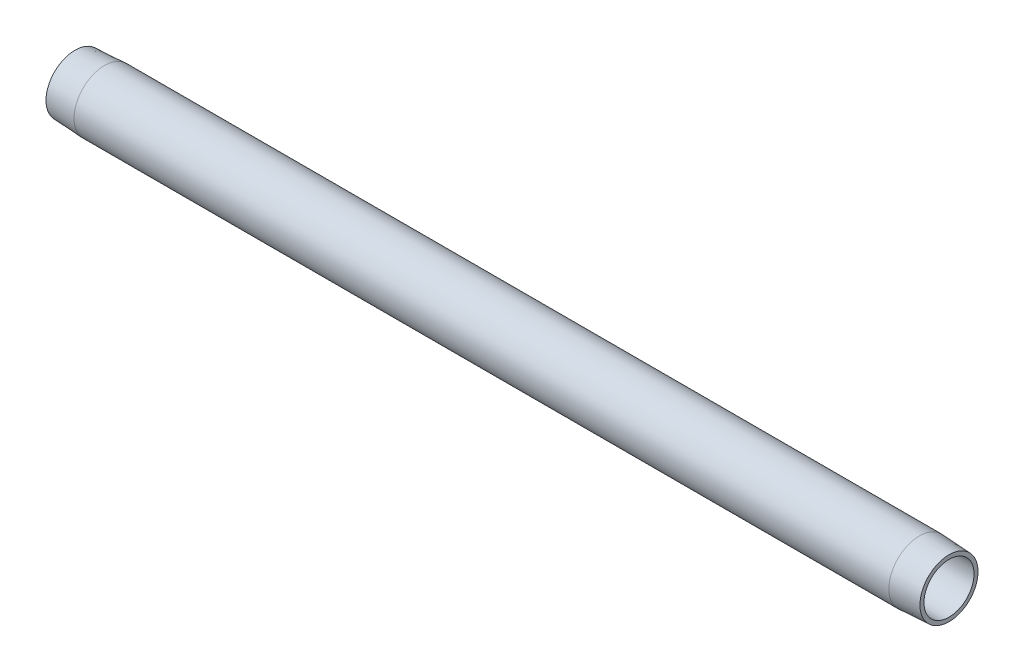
ISO-10303-21;
HEADER;
FILE_DESCRIPTION(('STEP AP214'),'2;1');
FILE_NAME('part.step','',(''),(''),'','','');
FILE_SCHEMA(('AUTOMOTIVE_DESIGN { 1 0 10303 214 1 1 1 1 }'));
ENDSEC;
DATA;
#1=APPLICATION_CONTEXT('core data for automotive mechanical design processes');
#2=APPLICATION_PROTOCOL_DEFINITION('international standard','automotive_design',2000,#1);
#3=PRODUCT_CONTEXT('',#1,'mechanical');
#4=PRODUCT('Part','Part','',(#3));
#5=PRODUCT_RELATED_PRODUCT_CATEGORY('part','',(#4));
#6=PRODUCT_DEFINITION_FORMATION('','',#4);
#7=PRODUCT_DEFINITION_CONTEXT('part definition',#1,'design');
#8=PRODUCT_DEFINITION('design','',#6,#7);
#9=PRODUCT_DEFINITION_SHAPE('','',#8);
#10=(LENGTH_UNIT() NAMED_UNIT(*) SI_UNIT(.MILLI.,.METRE.));
#11=(NAMED_UNIT(*) PLANE_ANGLE_UNIT() SI_UNIT($,.RADIAN.));
#12=(NAMED_UNIT(*) SI_UNIT($,.STERADIAN.) SOLID_ANGLE_UNIT());
#13=UNCERTAINTY_MEASURE_WITH_UNIT(LENGTH_MEASURE(1.E-05),#10,'distance_accuracy_value','');
#14=(GEOMETRIC_REPRESENTATION_CONTEXT(3) GLOBAL_UNCERTAINTY_ASSIGNED_CONTEXT((#13)) GLOBAL_UNIT_ASSIGNED_CONTEXT((#10,
#11,#12)) REPRESENTATION_CONTEXT('',''));
#15=CARTESIAN_POINT('',(0.,0.,0.));
#16=DIRECTION('',(0.,0.,1.));
#17=DIRECTION('',(1.,0.,0.));
#18=AXIS2_PLACEMENT_3D('',#15,#16,#17);
#19=CARTESIAN_POINT('',(304.8,8.73125,0.));
#20=DIRECTION('',(-1.,0.,0.));
#21=DIRECTION('',(0.,0.,1.));
#22=AXIS2_PLACEMENT_3D('',#19,#20,#21);
#23=PLANE('',#22);
#24=CARTESIAN_POINT('',(304.8,0.,0.));
#25=DIRECTION('',(-1.,0.,0.));
#26=DIRECTION('',(0.,0.,1.));
#27=AXIS2_PLACEMENT_3D('',#24,#25,#26);
#28=CIRCLE('',#27,10.1275500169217);
#29=CARTESIAN_POINT('',(304.8,0.,10.1275500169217));
#30=VERTEX_POINT('',#29);
#31=EDGE_CURVE('E10',#30,#30,#28,.T.);
#32=ORIENTED_EDGE('',*,*,#31,.F.);
#33=EDGE_LOOP('',(#32));
#34=FACE_BOUND('',#33,.T.);
#35=CARTESIAN_POINT('',(304.8,0.,0.));
#36=DIRECTION('',(-1.,0.,0.));
#37=DIRECTION('',(0.,0.,1.));
#38=AXIS2_PLACEMENT_3D('',#35,#36,#37);
#39=CIRCLE('',#38,8.73125);
#40=CARTESIAN_POINT('',(304.8,0.,8.73125));
#41=VERTEX_POINT('',#40);
#42=EDGE_CURVE('E52',#41,#41,#39,.T.);
#43=ORIENTED_EDGE('',*,*,#42,.T.);
#44=EDGE_LOOP('',(#43));
#45=FACE_BOUND('',#44,.T.);
#46=ADVANCED_FACE('F30',(#34,#45),#23,.F.);
#47=CARTESIAN_POINT('',(304.8,0.,0.));
#48=DIRECTION('',(-1.,0.,0.));
#49=DIRECTION('',(0.,0.,1.));
#50=AXIS2_PLACEMENT_3D('',#47,#48,#49);
#51=CONICAL_SURFACE('',#50,10.1275500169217,0.0523598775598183);
#52=CARTESIAN_POINT('',(294.4876,0.,0.));
#53=DIRECTION('',(-1.,0.,0.));
#54=DIRECTION('',(0.,0.,1.));
#55=AXIS2_PLACEMENT_3D('',#52,#53,#54);
#56=CIRCLE('',#55,10.668);
#57=CARTESIAN_POINT('',(294.4876,0.,10.668));
#58=VERTEX_POINT('',#57);
#59=EDGE_CURVE('E36',#58,#58,#56,.T.);
#60=ORIENTED_EDGE('',*,*,#59,.F.);
#61=EDGE_LOOP('',(#60));
#62=FACE_BOUND('',#61,.T.);
#63=ORIENTED_EDGE('',*,*,#31,.T.);
#64=EDGE_LOOP('',(#63));
#65=FACE_BOUND('',#64,.T.);
#66=ADVANCED_FACE('F77',(#62,#65),#51,.T.);
#67=CARTESIAN_POINT('',(0.,0.,0.));
#68=DIRECTION('',(-1.,0.,0.));
#69=DIRECTION('',(0.,0.,1.));
#70=AXIS2_PLACEMENT_3D('',#67,#68,#69);
#71=CYLINDRICAL_SURFACE('',#70,10.668);
#72=CARTESIAN_POINT('',(10.3124,0.,0.));
#73=DIRECTION('',(-1.,0.,0.));
#74=DIRECTION('',(0.,0.,1.));
#75=AXIS2_PLACEMENT_3D('',#72,#73,#74);
#76=CIRCLE('',#75,10.668);
#77=CARTESIAN_POINT('',(10.3124,0.,10.668));
#78=VERTEX_POINT('',#77);
#79=EDGE_CURVE('E40',#78,#78,#76,.T.);
#80=ORIENTED_EDGE('',*,*,#79,.F.);
#81=EDGE_LOOP('',(#80));
#82=FACE_BOUND('',#81,.T.);
#83=ORIENTED_EDGE('',*,*,#59,.T.);
#84=EDGE_LOOP('',(#83));
#85=FACE_BOUND('',#84,.T.);
#86=ADVANCED_FACE('F72',(#82,#85),#71,.T.);
#87=CARTESIAN_POINT('',(10.3124,0.,0.));
#88=DIRECTION('',(1.,0.,0.));
#89=DIRECTION('',(0.,0.,-1.));
#90=AXIS2_PLACEMENT_3D('',#87,#88,#89);
#91=CONICAL_SURFACE('',#90,10.668,0.0523598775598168);
#92=CARTESIAN_POINT('',(0.,0.,0.));
#93=DIRECTION('',(-1.,0.,0.));
#94=DIRECTION('',(0.,0.,1.));
#95=AXIS2_PLACEMENT_3D('',#92,#93,#94);
#96=CIRCLE('',#95,10.1275500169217);
#97=CARTESIAN_POINT('',(0.,0.,10.1275500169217));
#98=VERTEX_POINT('',#97);
#99=EDGE_CURVE('E44',#98,#98,#96,.T.);
#100=ORIENTED_EDGE('',*,*,#99,.F.);
#101=EDGE_LOOP('',(#100));
#102=FACE_BOUND('',#101,.T.);
#103=ORIENTED_EDGE('',*,*,#79,.T.);
#104=EDGE_LOOP('',(#103));
#105=FACE_BOUND('',#104,.T.);
#106=ADVANCED_FACE('F66',(#102,#105),#91,.T.);
#107=CARTESIAN_POINT('',(0.,10.1275500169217,0.));
#108=DIRECTION('',(1.,0.,0.));
#109=DIRECTION('',(0.,0.,-1.));
#110=AXIS2_PLACEMENT_3D('',#107,#108,#109);
#111=PLANE('',#110);
#112=CARTESIAN_POINT('',(0.,0.,0.));
#113=DIRECTION('',(-1.,0.,0.));
#114=DIRECTION('',(0.,0.,1.));
#115=AXIS2_PLACEMENT_3D('',#112,#113,#114);
#116=CIRCLE('',#115,8.73125);
#117=CARTESIAN_POINT('',(0.,0.,8.73125));
#118=VERTEX_POINT('',#117);
#119=EDGE_CURVE('E49',#118,#118,#116,.T.);
#120=ORIENTED_EDGE('',*,*,#119,.F.);
#121=EDGE_LOOP('',(#120));
#122=FACE_BOUND('',#121,.T.);
#123=ORIENTED_EDGE('',*,*,#99,.T.);
#124=EDGE_LOOP('',(#123));
#125=FACE_BOUND('',#124,.T.);
#126=ADVANCED_FACE('F60',(#122,#125),#111,.F.);
#127=CARTESIAN_POINT('',(0.,0.,0.));
#128=DIRECTION('',(-1.,0.,0.));
#129=DIRECTION('',(0.,0.,1.));
#130=AXIS2_PLACEMENT_3D('',#127,#128,#129);
#131=CYLINDRICAL_SURFACE('',#130,8.73125);
#132=ORIENTED_EDGE('',*,*,#42,.F.);
#133=EDGE_LOOP('',(#132));
#134=FACE_BOUND('',#133,.T.);
#135=ORIENTED_EDGE('',*,*,#119,.T.);
#136=EDGE_LOOP('',(#135));
#137=FACE_BOUND('',#136,.T.);
#138=ADVANCED_FACE('F57',(#134,#137),#131,.F.);
#139=CLOSED_SHELL('',(#46,#66,#86,#106,#126,#138));
#140=MANIFOLD_SOLID_BREP('B2',#139);
#141=ADVANCED_BREP_SHAPE_REPRESENTATION('',(#18,#140),#14);
#142=SHAPE_DEFINITION_REPRESENTATION(#9,#141);
ENDSEC;
END-ISO-10303-21;
